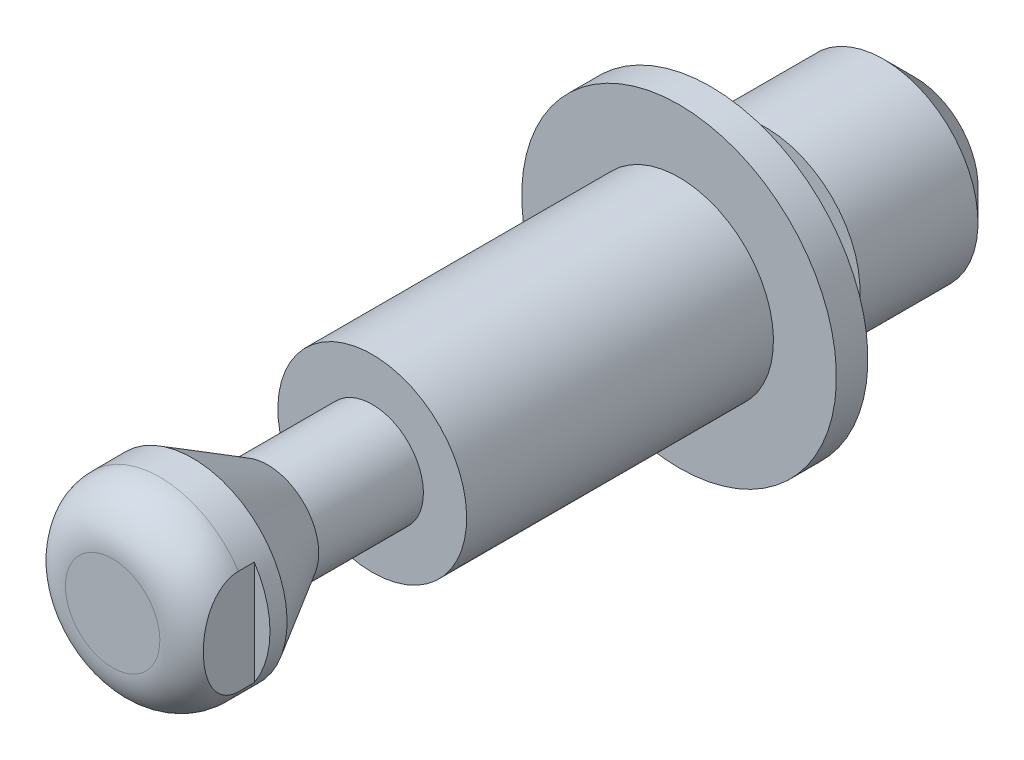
ISO-10303-21;
HEADER;
FILE_DESCRIPTION(('STEP AP214'),'2;1');
FILE_NAME('part.step','',(''),(''),'','','');
FILE_SCHEMA(('AUTOMOTIVE_DESIGN { 1 0 10303 214 1 1 1 1 }'));
ENDSEC;
DATA;
#1=APPLICATION_CONTEXT('core data for automotive mechanical design processes');
#2=APPLICATION_PROTOCOL_DEFINITION('international standard','automotive_design',2000,#1);
#3=PRODUCT_CONTEXT('',#1,'mechanical');
#4=PRODUCT('Part','Part','',(#3));
#5=PRODUCT_RELATED_PRODUCT_CATEGORY('part','',(#4));
#6=PRODUCT_DEFINITION_FORMATION('','',#4);
#7=PRODUCT_DEFINITION_CONTEXT('part definition',#1,'design');
#8=PRODUCT_DEFINITION('design','',#6,#7);
#9=PRODUCT_DEFINITION_SHAPE('','',#8);
#10=(LENGTH_UNIT() NAMED_UNIT(*) SI_UNIT(.MILLI.,.METRE.));
#11=(NAMED_UNIT(*) PLANE_ANGLE_UNIT() SI_UNIT($,.RADIAN.));
#12=(NAMED_UNIT(*) SI_UNIT($,.STERADIAN.) SOLID_ANGLE_UNIT());
#13=UNCERTAINTY_MEASURE_WITH_UNIT(LENGTH_MEASURE(1.E-05),#10,'distance_accuracy_value','');
#14=(GEOMETRIC_REPRESENTATION_CONTEXT(3) GLOBAL_UNCERTAINTY_ASSIGNED_CONTEXT((#13)) GLOBAL_UNIT_ASSIGNED_CONTEXT((#10,
#11,#12)) REPRESENTATION_CONTEXT('',''));
#15=CARTESIAN_POINT('',(0.,0.,0.));
#16=DIRECTION('',(0.,0.,1.));
#17=DIRECTION('',(1.,0.,0.));
#18=AXIS2_PLACEMENT_3D('',#15,#16,#17);
#19=CARTESIAN_POINT('',(0.,0.,0.));
#20=DIRECTION('',(0.,0.,-1.));
#21=DIRECTION('',(0.,1.,0.));
#22=AXIS2_PLACEMENT_3D('',#19,#20,#21);
#23=PLANE('',#22);
#24=CARTESIAN_POINT('',(0.,0.,0.));
#25=DIRECTION('',(0.,0.,1.));
#26=DIRECTION('',(0.,-1.,0.));
#27=AXIS2_PLACEMENT_3D('',#24,#25,#26);
#28=CIRCLE('',#27,10.);
#29=CARTESIAN_POINT('',(0.,-10.,0.));
#30=VERTEX_POINT('',#29);
#31=EDGE_CURVE('E107',#30,#30,#28,.T.);
#32=ORIENTED_EDGE('',*,*,#31,.F.);
#33=EDGE_LOOP('',(#32));
#34=FACE_BOUND('',#33,.T.);
#35=CARTESIAN_POINT('',(0.,0.,0.));
#36=DIRECTION('',(0.,0.,-1.));
#37=DIRECTION('',(1.,0.,0.));
#38=AXIS2_PLACEMENT_3D('',#35,#36,#37);
#39=CIRCLE('',#38,4.7);
#40=CARTESIAN_POINT('',(4.7,0.,0.));
#41=VERTEX_POINT('',#40);
#42=EDGE_CURVE('E82',#41,#41,#39,.T.);
#43=ORIENTED_EDGE('',*,*,#42,.F.);
#44=EDGE_LOOP('',(#43));
#45=FACE_BOUND('',#44,.T.);
#46=ADVANCED_FACE('F14',(#34,#45),#23,.T.);
#47=CARTESIAN_POINT('',(0.,0.,0.));
#48=DIRECTION('',(0.,0.,1.));
#49=DIRECTION('',(0.,-1.,0.));
#50=AXIS2_PLACEMENT_3D('',#47,#48,#49);
#51=CYLINDRICAL_SURFACE('',#50,10.);
#52=ORIENTED_EDGE('',*,*,#31,.T.);
#53=EDGE_LOOP('',(#52));
#54=FACE_BOUND('',#53,.T.);
#55=CARTESIAN_POINT('',(0.,0.,2.));
#56=DIRECTION('',(0.,0.,1.));
#57=DIRECTION('',(0.,-1.,0.));
#58=AXIS2_PLACEMENT_3D('',#55,#56,#57);
#59=CIRCLE('',#58,10.);
#60=CARTESIAN_POINT('',(0.,-10.,2.));
#61=VERTEX_POINT('',#60);
#62=EDGE_CURVE('E104',#61,#61,#59,.T.);
#63=ORIENTED_EDGE('',*,*,#62,.F.);
#64=EDGE_LOOP('',(#63));
#65=FACE_BOUND('',#64,.T.);
#66=ADVANCED_FACE('F157',(#54,#65),#51,.T.);
#67=CARTESIAN_POINT('',(0.,-10.,2.));
#68=DIRECTION('',(0.,0.,1.));
#69=DIRECTION('',(0.,-1.,0.));
#70=AXIS2_PLACEMENT_3D('',#67,#68,#69);
#71=PLANE('',#70);
#72=ORIENTED_EDGE('',*,*,#62,.T.);
#73=EDGE_LOOP('',(#72));
#74=FACE_BOUND('',#73,.T.);
#75=CARTESIAN_POINT('',(0.,0.,2.));
#76=DIRECTION('',(0.,0.,1.));
#77=DIRECTION('',(0.,-1.,0.));
#78=AXIS2_PLACEMENT_3D('',#75,#76,#77);
#79=CIRCLE('',#78,6.);
#80=CARTESIAN_POINT('',(0.,-6.,2.));
#81=VERTEX_POINT('',#80);
#82=EDGE_CURVE('E101',#81,#81,#79,.T.);
#83=ORIENTED_EDGE('',*,*,#82,.F.);
#84=EDGE_LOOP('',(#83));
#85=FACE_BOUND('',#84,.T.);
#86=ADVANCED_FACE('F163',(#74,#85),#71,.T.);
#87=CARTESIAN_POINT('',(0.,0.,0.));
#88=DIRECTION('',(0.,0.,1.));
#89=DIRECTION('',(0.,-1.,0.));
#90=AXIS2_PLACEMENT_3D('',#87,#88,#89);
#91=CYLINDRICAL_SURFACE('',#90,6.);
#92=ORIENTED_EDGE('',*,*,#82,.T.);
#93=EDGE_LOOP('',(#92));
#94=FACE_BOUND('',#93,.T.);
#95=CARTESIAN_POINT('',(0.,0.,21.5));
#96=DIRECTION('',(0.,0.,1.));
#97=DIRECTION('',(0.,-1.,0.));
#98=AXIS2_PLACEMENT_3D('',#95,#96,#97);
#99=CIRCLE('',#98,6.);
#100=CARTESIAN_POINT('',(0.,-6.,21.5));
#101=VERTEX_POINT('',#100);
#102=EDGE_CURVE('E98',#101,#101,#99,.T.);
#103=ORIENTED_EDGE('',*,*,#102,.F.);
#104=EDGE_LOOP('',(#103));
#105=FACE_BOUND('',#104,.T.);
#106=ADVANCED_FACE('F171',(#94,#105),#91,.T.);
#107=CARTESIAN_POINT('',(0.,-3.25,21.5));
#108=DIRECTION('',(0.,0.,1.));
#109=DIRECTION('',(0.,-1.,0.));
#110=AXIS2_PLACEMENT_3D('',#107,#108,#109);
#111=PLANE('',#110);
#112=ORIENTED_EDGE('',*,*,#102,.T.);
#113=EDGE_LOOP('',(#112));
#114=FACE_BOUND('',#113,.T.);
#115=CARTESIAN_POINT('',(0.,0.,21.5));
#116=DIRECTION('',(0.,0.,1.));
#117=DIRECTION('',(0.,-1.,0.));
#118=AXIS2_PLACEMENT_3D('',#115,#116,#117);
#119=CIRCLE('',#118,3.25);
#120=CARTESIAN_POINT('',(0.,-3.25,21.5));
#121=VERTEX_POINT('',#120);
#122=EDGE_CURVE('E95',#121,#121,#119,.T.);
#123=ORIENTED_EDGE('',*,*,#122,.F.);
#124=EDGE_LOOP('',(#123));
#125=FACE_BOUND('',#124,.T.);
#126=ADVANCED_FACE('F175',(#114,#125),#111,.T.);
#127=CARTESIAN_POINT('',(0.,0.,0.));
#128=DIRECTION('',(0.,0.,1.));
#129=DIRECTION('',(0.,-1.,0.));
#130=AXIS2_PLACEMENT_3D('',#127,#128,#129);
#131=CYLINDRICAL_SURFACE('',#130,3.25);
#132=ORIENTED_EDGE('',*,*,#122,.T.);
#133=EDGE_LOOP('',(#132));
#134=FACE_BOUND('',#133,.T.);
#135=CARTESIAN_POINT('',(0.,0.,28.15));
#136=DIRECTION('',(0.,0.,1.));
#137=DIRECTION('',(0.,-1.,0.));
#138=AXIS2_PLACEMENT_3D('',#135,#136,#137);
#139=CIRCLE('',#138,3.25);
#140=CARTESIAN_POINT('',(0.,-3.25,28.15));
#141=VERTEX_POINT('',#140);
#142=EDGE_CURVE('E92',#141,#141,#139,.T.);
#143=ORIENTED_EDGE('',*,*,#142,.F.);
#144=EDGE_LOOP('',(#143));
#145=FACE_BOUND('',#144,.T.);
#146=ADVANCED_FACE('F179',(#134,#145),#131,.T.);
#147=CARTESIAN_POINT('',(0.,0.,32.9131397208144));
#148=DIRECTION('',(0.,0.,1.));
#149=DIRECTION('',(0.,-1.,0.));
#150=AXIS2_PLACEMENT_3D('',#147,#148,#149);
#151=CONICAL_SURFACE('',#150,6.,0.5235987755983);
#152=ORIENTED_EDGE('',*,*,#142,.T.);
#153=EDGE_LOOP('',(#152));
#154=FACE_BOUND('',#153,.T.);
#155=CARTESIAN_POINT('',(0.,0.,32.9131397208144));
#156=DIRECTION('',(0.,0.,1.));
#157=DIRECTION('',(0.,-1.,0.));
#158=AXIS2_PLACEMENT_3D('',#155,#156,#157);
#159=CIRCLE('',#158,6.);
#160=CARTESIAN_POINT('',(0.,-6.,32.9131397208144));
#161=VERTEX_POINT('',#160);
#162=EDGE_CURVE('E89',#161,#161,#159,.T.);
#163=ORIENTED_EDGE('',*,*,#162,.F.);
#164=EDGE_LOOP('',(#163));
#165=FACE_BOUND('',#164,.T.);
#166=ADVANCED_FACE('F183',(#154,#165),#151,.T.);
#167=CARTESIAN_POINT('',(0.,0.,0.));
#168=DIRECTION('',(0.,0.,1.));
#169=DIRECTION('',(0.,-1.,0.));
#170=AXIS2_PLACEMENT_3D('',#167,#168,#169);
#171=CYLINDRICAL_SURFACE('',#170,6.);
#172=DIRECTION('',(0.,0.,1.));
#173=VECTOR('',#172,1.);
#174=CARTESIAN_POINT('',(5.,-3.31662479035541,0.));
#175=LINE('',#174,#173);
#176=CARTESIAN_POINT('',(5.,-3.31662479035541,35.));
#177=VERTEX_POINT('',#176);
#178=CARTESIAN_POINT('',(5.,-3.31662479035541,34.));
#179=VERTEX_POINT('',#178);
#180=EDGE_CURVE('E64',#177,#179,#175,.F.);
#181=ORIENTED_EDGE('',*,*,#180,.F.);
#182=CARTESIAN_POINT('',(0.,0.,35.));
#183=DIRECTION('',(0.,0.,1.));
#184=DIRECTION('',(0.,-1.,0.));
#185=AXIS2_PLACEMENT_3D('',#182,#183,#184);
#186=CIRCLE('',#185,6.);
#187=CARTESIAN_POINT('',(-5.,-3.31662479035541,35.));
#188=VERTEX_POINT('',#187);
#189=EDGE_CURVE('E37',#177,#188,#186,.F.);
#190=ORIENTED_EDGE('',*,*,#189,.T.);
#191=DIRECTION('',(0.,0.,1.));
#192=VECTOR('',#191,1.);
#193=CARTESIAN_POINT('',(-5.,-3.31662479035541,0.));
#194=LINE('',#193,#192);
#195=CARTESIAN_POINT('',(-5.,-3.31662479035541,34.));
#196=VERTEX_POINT('',#195);
#197=EDGE_CURVE('E78',#196,#188,#194,.T.);
#198=ORIENTED_EDGE('',*,*,#197,.F.);
#199=CARTESIAN_POINT('',(0.,0.,34.));
#200=DIRECTION('',(0.,0.,-1.));
#201=DIRECTION('',(1.,0.,0.));
#202=AXIS2_PLACEMENT_3D('',#199,#200,#201);
#203=CIRCLE('',#202,6.);
#204=CARTESIAN_POINT('',(-5.,3.31662479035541,34.));
#205=VERTEX_POINT('',#204);
#206=EDGE_CURVE('E123',#205,#196,#203,.F.);
#207=ORIENTED_EDGE('',*,*,#206,.F.);
#208=DIRECTION('',(0.,0.,1.));
#209=VECTOR('',#208,1.);
#210=CARTESIAN_POINT('',(-5.,3.31662479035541,0.));
#211=LINE('',#210,#209);
#212=CARTESIAN_POINT('',(-5.,3.31662479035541,35.));
#213=VERTEX_POINT('',#212);
#214=EDGE_CURVE('E80',#213,#205,#211,.F.);
#215=ORIENTED_EDGE('',*,*,#214,.F.);
#216=CARTESIAN_POINT('',(5.,3.31662479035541,35.));
#217=VERTEX_POINT('',#216);
#218=EDGE_CURVE('E71',#213,#217,#186,.F.);
#219=ORIENTED_EDGE('',*,*,#218,.T.);
#220=DIRECTION('',(0.,0.,1.));
#221=VECTOR('',#220,1.);
#222=CARTESIAN_POINT('',(5.,3.31662479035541,0.));
#223=LINE('',#222,#221);
#224=CARTESIAN_POINT('',(5.,3.31662479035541,34.));
#225=VERTEX_POINT('',#224);
#226=EDGE_CURVE('E29',#225,#217,#223,.T.);
#227=ORIENTED_EDGE('',*,*,#226,.F.);
#228=CARTESIAN_POINT('',(0.,0.,34.));
#229=DIRECTION('',(0.,0.,-1.));
#230=DIRECTION('',(1.,0.,0.));
#231=AXIS2_PLACEMENT_3D('',#228,#229,#230);
#232=CIRCLE('',#231,6.);
#233=EDGE_CURVE('E58',#179,#225,#232,.F.);
#234=ORIENTED_EDGE('',*,*,#233,.F.);
#235=EDGE_LOOP('',(#181,#190,#198,#207,#215,#219,#227,#234));
#236=FACE_BOUND('',#235,.T.);
#237=ORIENTED_EDGE('',*,*,#162,.T.);
#238=EDGE_LOOP('',(#237));
#239=FACE_BOUND('',#238,.T.);
#240=ADVANCED_FACE('F67',(#236,#239),#171,.T.);
#241=CARTESIAN_POINT('',(0.,0.,38.));
#242=DIRECTION('',(0.,0.,1.));
#243=DIRECTION('',(0.,-1.,0.));
#244=AXIS2_PLACEMENT_3D('',#241,#242,#243);
#245=PLANE('',#244);
#246=CARTESIAN_POINT('',(0.,0.,38.));
#247=DIRECTION('',(0.,0.,1.));
#248=DIRECTION('',(0.,-1.,0.));
#249=AXIS2_PLACEMENT_3D('',#246,#247,#248);
#250=CIRCLE('',#249,3.);
#251=CARTESIAN_POINT('',(0.,-3.,38.));
#252=VERTEX_POINT('',#251);
#253=EDGE_CURVE('E110',#252,#252,#250,.T.);
#254=ORIENTED_EDGE('',*,*,#253,.T.);
#255=EDGE_LOOP('',(#254));
#256=FACE_BOUND('',#255,.T.);
#257=ADVANCED_FACE('F189',(#256),#245,.T.);
#258=CARTESIAN_POINT('',(0.,0.,35.));
#259=DIRECTION('',(0.,0.,1.));
#260=DIRECTION('',(0.,-1.,0.));
#261=AXIS2_PLACEMENT_3D('',#258,#259,#260);
#262=DEGENERATE_TOROIDAL_SURFACE('',#261,3.,3.,.T.);
#263=CARTESIAN_POINT('',(5.,0.,37.2360679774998));
#264=CARTESIAN_POINT('',(5.,-0.120918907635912,37.2360654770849));
#265=CARTESIAN_POINT('',(5.,-0.241827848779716,37.2321569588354));
#266=CARTESIAN_POINT('',(5.,-0.483117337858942,37.2163673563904));
#267=CARTESIAN_POINT('',(5.,-0.603497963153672,37.204487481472));
#268=CARTESIAN_POINT('',(5.,-0.843175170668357,37.172309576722));
#269=CARTESIAN_POINT('',(5.,-0.962471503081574,37.1520096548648));
#270=CARTESIAN_POINT('',(5.,-1.19911813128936,37.1022831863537));
#271=CARTESIAN_POINT('',(5.,-1.31646901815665,37.0728594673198));
#272=CARTESIAN_POINT('',(5.,-1.59010251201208,36.9914925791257));
#273=CARTESIAN_POINT('',(5.,-1.74515200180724,36.9352545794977));
#274=CARTESIAN_POINT('',(5.,-2.0457254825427,36.8013699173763));
#275=CARTESIAN_POINT('',(5.,-2.19126336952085,36.7237553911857));
#276=CARTESIAN_POINT('',(5.,-2.43890308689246,36.5627711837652));
#277=CARTESIAN_POINT('',(5.,-2.54382254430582,36.4837739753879));
#278=CARTESIAN_POINT('',(5.,-2.7396282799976,36.3098769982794));
#279=CARTESIAN_POINT('',(5.,-2.83053188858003,36.214997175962));
#280=CARTESIAN_POINT('',(5.,-2.97723052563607,36.0301159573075));
#281=CARTESIAN_POINT('',(5.,-3.03641451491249,35.942813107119));
#282=CARTESIAN_POINT('',(5.,-3.13957828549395,35.7595839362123));
#283=CARTESIAN_POINT('',(5.,-3.18356514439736,35.6636616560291));
#284=CARTESIAN_POINT('',(5.,-3.25393965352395,35.4648474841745));
#285=CARTESIAN_POINT('',(5.,-3.28022077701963,35.3619174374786));
#286=CARTESIAN_POINT('',(5.,-3.31290834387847,35.1529411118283));
#287=CARTESIAN_POINT('',(5.,-3.31932342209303,35.0468962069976));
#288=CARTESIAN_POINT('',(5.,-3.31222176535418,34.8462659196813));
#289=CARTESIAN_POINT('',(5.,-3.30065386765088,34.7516055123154));
#290=CARTESIAN_POINT('',(5.,-3.26181910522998,34.5655953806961));
#291=CARTESIAN_POINT('',(5.,-3.23455371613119,34.4742453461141));
#292=CARTESIAN_POINT('',(5.,-3.16568011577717,34.2967666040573));
#293=CARTESIAN_POINT('',(5.,-3.12401645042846,34.2106596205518));
#294=CARTESIAN_POINT('',(5.,-3.02836892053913,34.0456244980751));
#295=CARTESIAN_POINT('',(5.,-2.97437928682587,33.9666997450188));
#296=CARTESIAN_POINT('',(5.,-2.83319578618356,33.7878200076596));
#297=CARTESIAN_POINT('',(5.,-2.74125094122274,33.6916074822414));
#298=CARTESIAN_POINT('',(5.,-2.54296994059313,33.5154254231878));
#299=CARTESIAN_POINT('',(5.,-2.43660860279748,33.4354849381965));
#300=CARTESIAN_POINT('',(5.,-2.16830650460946,33.2616870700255));
#301=CARTESIAN_POINT('',(5.,-2.00142235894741,33.1755042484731));
#302=CARTESIAN_POINT('',(5.,-1.65626349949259,33.0302057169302));
#303=CARTESIAN_POINT('',(5.,-1.47796334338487,32.9711530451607));
#304=CARTESIAN_POINT('',(5.,-1.15914275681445,32.8876929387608));
#305=CARTESIAN_POINT('',(5.,-1.01985771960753,32.8583678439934));
#306=CARTESIAN_POINT('',(5.,-0.739223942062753,32.8117236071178));
#307=CARTESIAN_POINT('',(5.,-0.597874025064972,32.7944116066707));
#308=CARTESIAN_POINT('',(5.,-0.314037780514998,32.7709143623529));
#309=CARTESIAN_POINT('',(5.,-0.171549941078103,32.7647478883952));
#310=CARTESIAN_POINT('',(5.,0.113440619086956,32.7632671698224));
#311=CARTESIAN_POINT('',(5.,0.255943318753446,32.7679492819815));
#312=CARTESIAN_POINT('',(5.,0.518018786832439,32.7868218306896));
#313=CARTESIAN_POINT('',(5.,0.637707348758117,32.7994184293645));
#314=CARTESIAN_POINT('',(5.,0.875936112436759,32.8330000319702));
#315=CARTESIAN_POINT('',(5.,0.994476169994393,32.8539860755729));
#316=CARTESIAN_POINT('',(5.,1.22924960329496,32.9049977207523));
#317=CARTESIAN_POINT('',(5.,1.34548886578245,32.9349958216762));
#318=CARTESIAN_POINT('',(5.,1.57487815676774,33.0049676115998));
#319=CARTESIAN_POINT('',(5.,1.68802992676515,33.0449355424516));
#320=CARTESIAN_POINT('',(5.,1.93726711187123,33.1471729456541));
#321=CARTESIAN_POINT('',(5.,2.07212579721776,33.2125115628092));
#322=CARTESIAN_POINT('',(5.,2.33077391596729,33.3624490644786));
#323=CARTESIAN_POINT('',(5.,2.45457463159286,33.4470279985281));
#324=CARTESIAN_POINT('',(5.,2.66253632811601,33.6179675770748));
#325=CARTESIAN_POINT('',(5.,2.74969244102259,33.7006594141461));
#326=CARTESIAN_POINT('',(5.,2.90941931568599,33.8791550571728));
#327=CARTESIAN_POINT('',(5.,2.98200679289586,33.9749436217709));
#328=CARTESIAN_POINT('',(5.,3.0982354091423,34.1618145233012));
#329=CARTESIAN_POINT('',(5.,3.14465751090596,34.2511615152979));
#330=CARTESIAN_POINT('',(5.,3.22195881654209,34.4363821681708));
#331=CARTESIAN_POINT('',(5.,3.25284467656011,34.5322530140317));
#332=CARTESIAN_POINT('',(5.,3.29731276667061,34.7283734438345));
#333=CARTESIAN_POINT('',(5.,3.31082509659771,34.8286390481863));
#334=CARTESIAN_POINT('',(5.,3.31940920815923,35.0299567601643));
#335=CARTESIAN_POINT('',(5.,3.31448404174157,35.1310087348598));
#336=CARTESIAN_POINT('',(5.,3.28751634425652,35.3236265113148));
#337=CARTESIAN_POINT('',(5.,3.26668052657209,35.4153652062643));
#338=CARTESIAN_POINT('',(5.,3.21051142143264,35.5942547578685));
#339=CARTESIAN_POINT('',(5.,3.17517729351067,35.6814053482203));
#340=CARTESIAN_POINT('',(5.,3.08996682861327,35.8529027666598));
#341=CARTESIAN_POINT('',(5.,3.03953428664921,35.9369712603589));
#342=CARTESIAN_POINT('',(5.,2.92708168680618,36.0969044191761));
#343=CARTESIAN_POINT('',(5.,2.86505640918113,36.1727653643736));
#344=CARTESIAN_POINT('',(5.,2.70091379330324,36.3486262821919));
#345=CARTESIAN_POINT('',(5.,2.59347912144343,36.4436767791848));
#346=CARTESIAN_POINT('',(5.,2.36468756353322,36.6152304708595));
#347=CARTESIAN_POINT('',(5.,2.24329783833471,36.6916885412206));
#348=CARTESIAN_POINT('',(5.,1.93419060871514,36.8581380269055));
#349=CARTESIAN_POINT('',(5.,1.74132926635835,36.9385798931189));
#350=CARTESIAN_POINT('',(5.,1.44490972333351,37.0360436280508));
#351=CARTESIAN_POINT('',(5.,1.34482286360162,37.0646801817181));
#352=CARTESIAN_POINT('',(5.,1.14288449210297,37.1148876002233));
#353=CARTESIAN_POINT('',(5.,1.04103334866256,37.1364599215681));
#354=CARTESIAN_POINT('',(5.,0.783859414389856,37.1824311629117));
#355=CARTESIAN_POINT('',(5.,0.62778968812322,37.2026484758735));
#356=CARTESIAN_POINT('',(5.,0.314474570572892,37.2294704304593));
#357=CARTESIAN_POINT('',(5.,0.15722885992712,37.2360712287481));
#358=CARTESIAN_POINT('',(5.,0.,37.2360679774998));
#359=B_SPLINE_CURVE_WITH_KNOTS('',3,(#263,#264,#265,#266,#267,#268,#269,#270,#271,#272,#273,
#274,#275,#276,#277,#278,#279,#280,#281,#282,#283,#284,#285,#286,#287,#288,#289,#290,#291,#292,
#293,#294,#295,#296,#297,#298,#299,#300,#301,#302,#303,#304,#305,#306,#307,#308,#309,#310,#311,
#312,#313,#314,#315,#316,#317,#318,#319,#320,#321,#322,#323,#324,#325,#326,#327,#328,#329,#330,
#331,#332,#333,#334,#335,#336,#337,#338,#339,#340,#341,#342,#343,#344,#345,#346,#347,#348,#349,
#350,#351,#352,#353,#354,#355,#356,#357,#358),.UNSPECIFIED.,.T.,.F.,(4,2,2,2,2,2,2,2,2,2,2,2,2,
2,2,2,2,2,2,2,2,2,2,2,2,2,2,2,2,2,2,2,2,2,2,2,2,2,2,2,2,2,2,2,2,2,2,4),(0.,0.362673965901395,
0.725292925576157,1.08799341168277,1.45058160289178,1.94401806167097,2.43671672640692,
2.8293214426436,3.22143674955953,3.53657847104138,3.85157322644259,4.16844661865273,
4.48518226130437,4.76990781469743,5.05460660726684,5.34041435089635,5.62635614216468,
6.02338925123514,6.4211250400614,6.98148877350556,7.54314803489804,7.96962891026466,
8.39636310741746,8.82381529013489,9.25112394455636,9.61190509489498,9.97273096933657,
10.332466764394,10.6919952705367,11.1401969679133,11.5879360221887,11.9470202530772,
12.3056901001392,12.6064755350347,12.9071319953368,13.2089943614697,13.5108067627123,
13.7917573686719,14.072724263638,14.3656805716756,14.6587691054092,15.0866864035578,
15.515632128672,16.1388153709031,16.4509640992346,16.7630484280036,17.2344943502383,
17.7060733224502),.UNSPECIFIED.);
#360=EDGE_CURVE('E61',#217,#177,#359,.T.);
#361=ORIENTED_EDGE('',*,*,#360,.F.);
#362=ORIENTED_EDGE('',*,*,#218,.F.);
#363=CARTESIAN_POINT('',(-5.,0.,37.2360679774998));
#364=CARTESIAN_POINT('',(-5.,0.12091890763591,37.2360654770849));
#365=CARTESIAN_POINT('',(-5.,0.241827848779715,37.2321569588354));
#366=CARTESIAN_POINT('',(-5.,0.483117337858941,37.2163673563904));
#367=CARTESIAN_POINT('',(-5.,0.603497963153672,37.204487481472));
#368=CARTESIAN_POINT('',(-5.,0.843175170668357,37.172309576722));
#369=CARTESIAN_POINT('',(-5.,0.962471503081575,37.1520096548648));
#370=CARTESIAN_POINT('',(-5.,1.19911813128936,37.1022831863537));
#371=CARTESIAN_POINT('',(-5.,1.31646901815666,37.0728594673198));
#372=CARTESIAN_POINT('',(-5.,1.59010251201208,36.9914925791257));
#373=CARTESIAN_POINT('',(-5.,1.74515200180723,36.9352545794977));
#374=CARTESIAN_POINT('',(-5.,2.0457254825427,36.8013699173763));
#375=CARTESIAN_POINT('',(-5.,2.19126336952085,36.7237553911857));
#376=CARTESIAN_POINT('',(-5.,2.43890308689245,36.5627711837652));
#377=CARTESIAN_POINT('',(-5.,2.54382254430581,36.4837739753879));
#378=CARTESIAN_POINT('',(-5.,2.73962827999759,36.3098769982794));
#379=CARTESIAN_POINT('',(-5.,2.83053188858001,36.214997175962));
#380=CARTESIAN_POINT('',(-5.,2.97723052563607,36.0301159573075));
#381=CARTESIAN_POINT('',(-5.,3.03641451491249,35.942813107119));
#382=CARTESIAN_POINT('',(-5.,3.13957828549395,35.7595839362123));
#383=CARTESIAN_POINT('',(-5.,3.18356514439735,35.6636616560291));
#384=CARTESIAN_POINT('',(-5.,3.25393965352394,35.4648474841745));
#385=CARTESIAN_POINT('',(-5.,3.28022077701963,35.3619174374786));
#386=CARTESIAN_POINT('',(-5.,3.31290834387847,35.1529411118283));
#387=CARTESIAN_POINT('',(-5.,3.31932342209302,35.0468962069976));
#388=CARTESIAN_POINT('',(-5.,3.31222176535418,34.8462659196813));
#389=CARTESIAN_POINT('',(-5.,3.30065386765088,34.7516055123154));
#390=CARTESIAN_POINT('',(-5.,3.26181910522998,34.5655953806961));
#391=CARTESIAN_POINT('',(-5.,3.23455371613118,34.4742453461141));
#392=CARTESIAN_POINT('',(-5.,3.16568011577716,34.2967666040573));
#393=CARTESIAN_POINT('',(-5.,3.12401645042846,34.2106596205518));
#394=CARTESIAN_POINT('',(-5.,3.02836892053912,34.0456244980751));
#395=CARTESIAN_POINT('',(-5.,2.97437928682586,33.9666997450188));
#396=CARTESIAN_POINT('',(-5.,2.83319578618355,33.7878200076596));
#397=CARTESIAN_POINT('',(-5.,2.74125094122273,33.6916074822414));
#398=CARTESIAN_POINT('',(-5.,2.54296994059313,33.5154254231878));
#399=CARTESIAN_POINT('',(-5.,2.43660860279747,33.4354849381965));
#400=CARTESIAN_POINT('',(-5.,2.16830650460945,33.2616870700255));
#401=CARTESIAN_POINT('',(-5.,2.0014223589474,33.1755042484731));
#402=CARTESIAN_POINT('',(-5.,1.65626349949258,33.0302057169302));
#403=CARTESIAN_POINT('',(-5.,1.47796334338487,32.9711530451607));
#404=CARTESIAN_POINT('',(-5.,1.15914275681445,32.8876929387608));
#405=CARTESIAN_POINT('',(-5.,1.01985771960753,32.8583678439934));
#406=CARTESIAN_POINT('',(-5.,0.739223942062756,32.8117236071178));
#407=CARTESIAN_POINT('',(-5.,0.597874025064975,32.7944116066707));
#408=CARTESIAN_POINT('',(-5.,0.314037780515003,32.7709143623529));
#409=CARTESIAN_POINT('',(-5.,0.17154994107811,32.7647478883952));
#410=CARTESIAN_POINT('',(-5.,-0.113440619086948,32.7632671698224));
#411=CARTESIAN_POINT('',(-5.,-0.255943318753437,32.7679492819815));
#412=CARTESIAN_POINT('',(-5.,-0.518018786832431,32.7868218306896));
#413=CARTESIAN_POINT('',(-5.,-0.63770734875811,32.7994184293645));
#414=CARTESIAN_POINT('',(-5.,-0.875936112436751,32.8330000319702));
#415=CARTESIAN_POINT('',(-5.,-0.994476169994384,32.8539860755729));
#416=CARTESIAN_POINT('',(-5.,-1.22924960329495,32.9049977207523));
#417=CARTESIAN_POINT('',(-5.,-1.34548886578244,32.9349958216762));
#418=CARTESIAN_POINT('',(-5.,-1.57487815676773,33.0049676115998));
#419=CARTESIAN_POINT('',(-5.,-1.68802992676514,33.0449355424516));
#420=CARTESIAN_POINT('',(-5.,-1.93726711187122,33.1471729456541));
#421=CARTESIAN_POINT('',(-5.,-2.07212579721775,33.2125115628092));
#422=CARTESIAN_POINT('',(-5.,-2.33077391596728,33.3624490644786));
#423=CARTESIAN_POINT('',(-5.,-2.45457463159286,33.4470279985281));
#424=CARTESIAN_POINT('',(-5.,-2.66253632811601,33.6179675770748));
#425=CARTESIAN_POINT('',(-5.,-2.74969244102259,33.7006594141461));
#426=CARTESIAN_POINT('',(-5.,-2.90941931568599,33.8791550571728));
#427=CARTESIAN_POINT('',(-5.,-2.98200679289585,33.9749436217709));
#428=CARTESIAN_POINT('',(-5.,-3.0982354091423,34.1618145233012));
#429=CARTESIAN_POINT('',(-5.,-3.14465751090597,34.2511615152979));
#430=CARTESIAN_POINT('',(-5.,-3.2219588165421,34.4363821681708));
#431=CARTESIAN_POINT('',(-5.,-3.2528446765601,34.5322530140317));
#432=CARTESIAN_POINT('',(-5.,-3.2973127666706,34.7283734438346));
#433=CARTESIAN_POINT('',(-5.,-3.31082509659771,34.8286390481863));
#434=CARTESIAN_POINT('',(-5.,-3.31940920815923,35.0299567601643));
#435=CARTESIAN_POINT('',(-5.,-3.31448404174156,35.1310087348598));
#436=CARTESIAN_POINT('',(-5.,-3.28751634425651,35.3236265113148));
#437=CARTESIAN_POINT('',(-5.,-3.26668052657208,35.4153652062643));
#438=CARTESIAN_POINT('',(-5.,-3.21051142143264,35.5942547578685));
#439=CARTESIAN_POINT('',(-5.,-3.17517729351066,35.6814053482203));
#440=CARTESIAN_POINT('',(-5.,-3.08996682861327,35.8529027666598));
#441=CARTESIAN_POINT('',(-5.,-3.03953428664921,35.9369712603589));
#442=CARTESIAN_POINT('',(-5.,-2.92708168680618,36.0969044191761));
#443=CARTESIAN_POINT('',(-5.,-2.86505640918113,36.1727653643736));
#444=CARTESIAN_POINT('',(-5.,-2.70091379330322,36.3486262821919));
#445=CARTESIAN_POINT('',(-5.,-2.59347912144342,36.4436767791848));
#446=CARTESIAN_POINT('',(-5.,-2.36468756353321,36.6152304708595));
#447=CARTESIAN_POINT('',(-5.,-2.2432978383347,36.6916885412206));
#448=CARTESIAN_POINT('',(-5.,-1.93419060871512,36.8581380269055));
#449=CARTESIAN_POINT('',(-5.,-1.74132926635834,36.9385798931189));
#450=CARTESIAN_POINT('',(-5.,-1.44490972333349,37.0360436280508));
#451=CARTESIAN_POINT('',(-5.,-1.3448228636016,37.0646801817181));
#452=CARTESIAN_POINT('',(-5.,-1.14288449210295,37.1148876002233));
#453=CARTESIAN_POINT('',(-5.,-1.04103334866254,37.1364599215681));
#454=CARTESIAN_POINT('',(-5.,-0.78385941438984,37.1824311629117));
#455=CARTESIAN_POINT('',(-5.,-0.62778968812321,37.2026484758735));
#456=CARTESIAN_POINT('',(-5.,-0.314474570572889,37.2294704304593));
#457=CARTESIAN_POINT('',(-5.,-0.157228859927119,37.2360712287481));
#458=CARTESIAN_POINT('',(-5.,0.,37.2360679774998));
#459=B_SPLINE_CURVE_WITH_KNOTS('',3,(#363,#364,#365,#366,#367,#368,#369,#370,#371,#372,#373,
#374,#375,#376,#377,#378,#379,#380,#381,#382,#383,#384,#385,#386,#387,#388,#389,#390,#391,#392,
#393,#394,#395,#396,#397,#398,#399,#400,#401,#402,#403,#404,#405,#406,#407,#408,#409,#410,#411,
#412,#413,#414,#415,#416,#417,#418,#419,#420,#421,#422,#423,#424,#425,#426,#427,#428,#429,#430,
#431,#432,#433,#434,#435,#436,#437,#438,#439,#440,#441,#442,#443,#444,#445,#446,#447,#448,#449,
#450,#451,#452,#453,#454,#455,#456,#457,#458),.UNSPECIFIED.,.T.,.F.,(4,2,2,2,2,2,2,2,2,2,2,2,2,
2,2,2,2,2,2,2,2,2,2,2,2,2,2,2,2,2,2,2,2,2,2,2,2,2,2,2,2,2,2,2,2,2,2,4),(0.,0.362673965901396,
0.725292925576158,1.08799341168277,1.45058160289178,1.94401806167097,2.43671672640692,
2.82932144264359,3.22143674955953,3.53657847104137,3.85157322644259,4.16844661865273,
4.48518226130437,4.76990781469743,5.05460660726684,5.34041435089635,5.62635614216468,
6.02338925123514,6.42112504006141,6.98148877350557,7.54314803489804,7.96962891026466,
8.39636310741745,8.82381529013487,9.25112394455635,9.61190509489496,9.97273096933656,
10.332466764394,10.6919952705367,11.1401969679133,11.5879360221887,11.9470202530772,
12.3056901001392,12.6064755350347,12.9071319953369,13.2089943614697,13.5108067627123,
13.7917573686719,14.072724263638,14.3656805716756,14.6587691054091,15.0866864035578,
15.515632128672,16.1388153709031,16.4509640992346,16.7630484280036,17.2344943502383,
17.7060733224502),.UNSPECIFIED.);
#460=EDGE_CURVE('E114',#188,#213,#459,.T.);
#461=ORIENTED_EDGE('',*,*,#460,.F.);
#462=ORIENTED_EDGE('',*,*,#189,.F.);
#463=EDGE_LOOP('',(#361,#362,#461,#462));
#464=FACE_BOUND('',#463,.T.);
#465=ORIENTED_EDGE('',*,*,#253,.F.);
#466=EDGE_LOOP('',(#465));
#467=FACE_BOUND('',#466,.T.);
#468=ADVANCED_FACE('F125',(#464,#467),#262,.T.);
#469=CARTESIAN_POINT('',(0.,-4.7,-3.5));
#470=DIRECTION('',(0.,0.,1.));
#471=DIRECTION('',(-1.,0.,0.));
#472=AXIS2_PLACEMENT_3D('',#469,#470,#471);
#473=PLANE('',#472);
#474=CARTESIAN_POINT('',(0.,0.,-3.5));
#475=DIRECTION('',(0.,0.,-1.));
#476=DIRECTION('',(1.,0.,0.));
#477=AXIS2_PLACEMENT_3D('',#474,#475,#476);
#478=CIRCLE('',#477,4.7);
#479=CARTESIAN_POINT('',(4.7,0.,-3.5));
#480=VERTEX_POINT('',#479);
#481=EDGE_CURVE('E85',#480,#480,#478,.T.);
#482=ORIENTED_EDGE('',*,*,#481,.T.);
#483=EDGE_LOOP('',(#482));
#484=FACE_BOUND('',#483,.T.);
#485=CARTESIAN_POINT('',(0.,0.,-3.5));
#486=DIRECTION('',(0.,0.,1.));
#487=DIRECTION('',(-1.,0.,0.));
#488=AXIS2_PLACEMENT_3D('',#485,#486,#487);
#489=CIRCLE('',#488,6.);
#490=CARTESIAN_POINT('',(-6.,0.,-3.5));
#491=VERTEX_POINT('',#490);
#492=EDGE_CURVE('E88',#491,#491,#489,.T.);
#493=ORIENTED_EDGE('',*,*,#492,.T.);
#494=EDGE_LOOP('',(#493));
#495=FACE_BOUND('',#494,.T.);
#496=ADVANCED_FACE('F142',(#484,#495),#473,.T.);
#497=CARTESIAN_POINT('',(0.,0.,-4.66905042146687));
#498=DIRECTION('',(0.,0.,-1.));
#499=DIRECTION('',(1.,0.,0.));
#500=AXIS2_PLACEMENT_3D('',#497,#498,#499);
#501=CYLINDRICAL_SURFACE('',#500,4.7);
#502=ORIENTED_EDGE('',*,*,#42,.T.);
#503=EDGE_LOOP('',(#502));
#504=FACE_BOUND('',#503,.T.);
#505=ORIENTED_EDGE('',*,*,#481,.F.);
#506=EDGE_LOOP('',(#505));
#507=FACE_BOUND('',#506,.T.);
#508=ADVANCED_FACE('F138',(#504,#507),#501,.T.);
#509=CARTESIAN_POINT('',(0.,0.,-13.));
#510=DIRECTION('',(0.,0.,-1.));
#511=DIRECTION('',(0.,1.,0.));
#512=AXIS2_PLACEMENT_3D('',#509,#510,#511);
#513=PLANE('',#512);
#514=CARTESIAN_POINT('',(0.,0.,-13.));
#515=DIRECTION('',(0.,0.,-1.));
#516=DIRECTION('',(0.,1.,0.));
#517=AXIS2_PLACEMENT_3D('',#514,#515,#516);
#518=CIRCLE('',#517,4.);
#519=CARTESIAN_POINT('',(0.,4.,-13.));
#520=VERTEX_POINT('',#519);
#521=EDGE_CURVE('E22',#520,#520,#518,.T.);
#522=ORIENTED_EDGE('',*,*,#521,.T.);
#523=EDGE_LOOP('',(#522));
#524=FACE_BOUND('',#523,.T.);
#525=ADVANCED_FACE('F141',(#524),#513,.T.);
#526=CARTESIAN_POINT('',(0.,0.,-13.));
#527=DIRECTION('',(0.,0.,1.));
#528=DIRECTION('',(0.,-1.,0.));
#529=AXIS2_PLACEMENT_3D('',#526,#527,#528);
#530=CYLINDRICAL_SURFACE('',#529,6.);
#531=CARTESIAN_POINT('',(0.,0.,-11.));
#532=DIRECTION('',(0.,0.,-1.));
#533=DIRECTION('',(0.,1.,0.));
#534=AXIS2_PLACEMENT_3D('',#531,#532,#533);
#535=CIRCLE('',#534,6.);
#536=CARTESIAN_POINT('',(0.,6.,-11.));
#537=VERTEX_POINT('',#536);
#538=EDGE_CURVE('E9',#537,#537,#535,.F.);
#539=ORIENTED_EDGE('',*,*,#538,.T.);
#540=EDGE_LOOP('',(#539));
#541=FACE_BOUND('',#540,.T.);
#542=ORIENTED_EDGE('',*,*,#492,.F.);
#543=EDGE_LOOP('',(#542));
#544=FACE_BOUND('',#543,.T.);
#545=ADVANCED_FACE('F135',(#541,#544),#530,.T.);
#546=CARTESIAN_POINT('',(-5.,21.5,34.));
#547=DIRECTION('',(1.,0.,0.));
#548=DIRECTION('',(0.,0.,1.));
#549=AXIS2_PLACEMENT_3D('',#546,#547,#548);
#550=PLANE('',#549);
#551=ORIENTED_EDGE('',*,*,#214,.T.);
#552=DIRECTION('',(0.,-1.,0.));
#553=VECTOR('',#552,1.);
#554=CARTESIAN_POINT('',(-5.,21.5,34.));
#555=LINE('',#554,#553);
#556=EDGE_CURVE('E73',#205,#196,#555,.T.);
#557=ORIENTED_EDGE('',*,*,#556,.T.);
#558=ORIENTED_EDGE('',*,*,#197,.T.);
#559=ORIENTED_EDGE('',*,*,#460,.T.);
#560=EDGE_LOOP('',(#551,#557,#558,#559));
#561=FACE_BOUND('',#560,.T.);
#562=ADVANCED_FACE('F129',(#561),#550,.F.);
#563=CARTESIAN_POINT('',(-5.,21.5,34.));
#564=DIRECTION('',(0.,0.,-1.));
#565=DIRECTION('',(1.,0.,0.));
#566=AXIS2_PLACEMENT_3D('',#563,#564,#565);
#567=PLANE('',#566);
#568=ORIENTED_EDGE('',*,*,#206,.T.);
#569=ORIENTED_EDGE('',*,*,#556,.F.);
#570=EDGE_LOOP('',(#568,#569));
#571=FACE_BOUND('',#570,.T.);
#572=ADVANCED_FACE('F134',(#571),#567,.F.);
#573=CARTESIAN_POINT('',(5.,21.5,34.));
#574=DIRECTION('',(0.,0.,-1.));
#575=DIRECTION('',(1.,0.,0.));
#576=AXIS2_PLACEMENT_3D('',#573,#574,#575);
#577=PLANE('',#576);
#578=ORIENTED_EDGE('',*,*,#233,.T.);
#579=DIRECTION('',(0.,-1.,0.));
#580=VECTOR('',#579,1.);
#581=CARTESIAN_POINT('',(5.,21.5,34.));
#582=LINE('',#581,#580);
#583=EDGE_CURVE('E60',#225,#179,#582,.T.);
#584=ORIENTED_EDGE('',*,*,#583,.T.);
#585=EDGE_LOOP('',(#578,#584));
#586=FACE_BOUND('',#585,.T.);
#587=ADVANCED_FACE('F59',(#586),#577,.F.);
#588=CARTESIAN_POINT('',(5.,21.5,34.));
#589=DIRECTION('',(-1.,0.,0.));
#590=DIRECTION('',(0.,0.,-1.));
#591=AXIS2_PLACEMENT_3D('',#588,#589,#590);
#592=PLANE('',#591);
#593=ORIENTED_EDGE('',*,*,#180,.T.);
#594=ORIENTED_EDGE('',*,*,#583,.F.);
#595=ORIENTED_EDGE('',*,*,#226,.T.);
#596=ORIENTED_EDGE('',*,*,#360,.T.);
#597=EDGE_LOOP('',(#593,#594,#595,#596));
#598=FACE_BOUND('',#597,.T.);
#599=ADVANCED_FACE('F63',(#598),#592,.F.);
#600=CARTESIAN_POINT('',(0.,0.,-13.));
#601=DIRECTION('',(0.,0.,1.));
#602=DIRECTION('',(0.,-1.,0.));
#603=AXIS2_PLACEMENT_3D('',#600,#601,#602);
#604=CONICAL_SURFACE('',#603,4.,0.785398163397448);
#605=ORIENTED_EDGE('',*,*,#538,.F.);
#606=EDGE_LOOP('',(#605));
#607=FACE_BOUND('',#606,.T.);
#608=ORIENTED_EDGE('',*,*,#521,.F.);
#609=EDGE_LOOP('',(#608));
#610=FACE_BOUND('',#609,.T.);
#611=ADVANCED_FACE('F16',(#607,#610),#604,.T.);
#612=CLOSED_SHELL('',(#46,#66,#86,#106,#126,#146,#166,#240,#257,#468,#496,#508,#525,#545,#562,
#572,#587,#599,#611));
#613=MANIFOLD_SOLID_BREP('B1',#612);
#614=ADVANCED_BREP_SHAPE_REPRESENTATION('',(#18,#613),#14);
#615=SHAPE_DEFINITION_REPRESENTATION(#9,#614);
ENDSEC;
END-ISO-10303-21;
